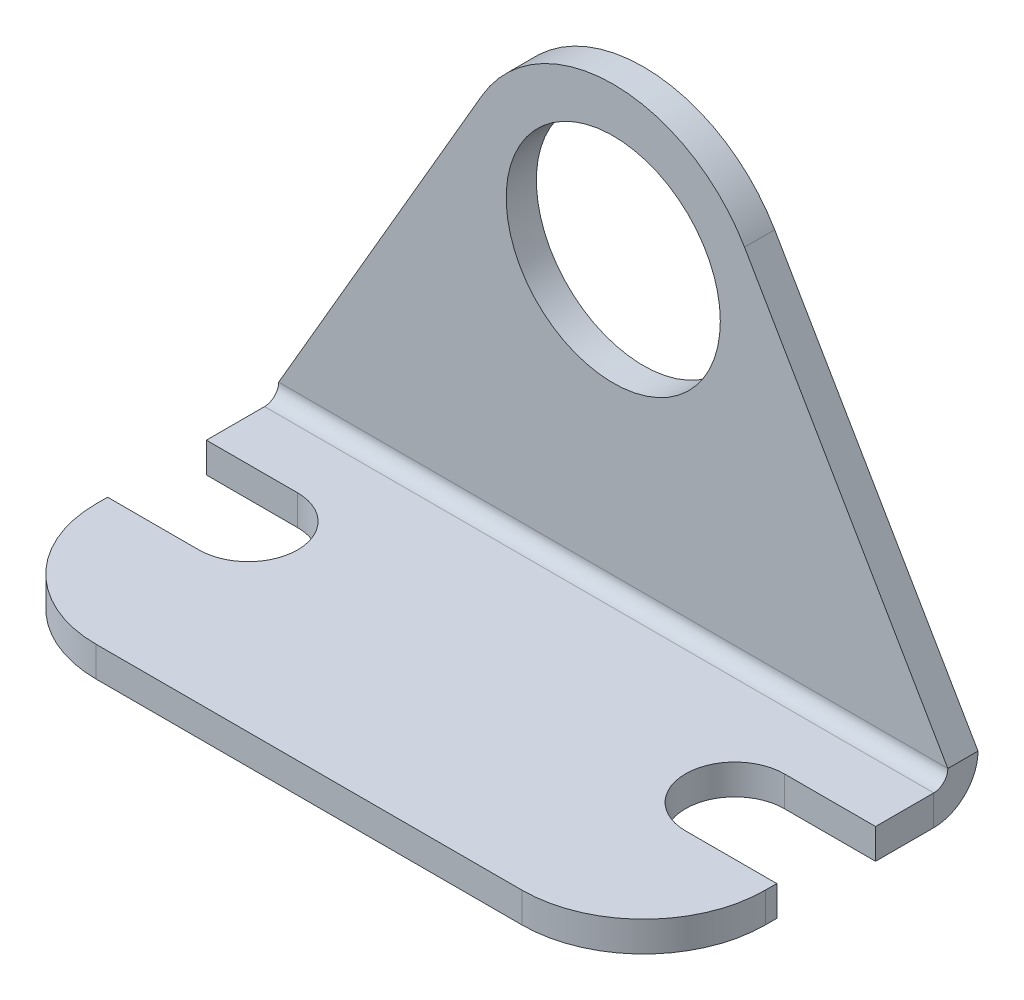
ISO-10303-21;
HEADER;
FILE_DESCRIPTION(('STEP AP214'),'2;1');
FILE_NAME('part.step','',(''),(''),'','','');
FILE_SCHEMA(('AUTOMOTIVE_DESIGN { 1 0 10303 214 1 1 1 1 }'));
ENDSEC;
DATA;
#1=APPLICATION_CONTEXT('core data for automotive mechanical design processes');
#2=APPLICATION_PROTOCOL_DEFINITION('international standard','automotive_design',2000,#1);
#3=PRODUCT_CONTEXT('',#1,'mechanical');
#4=PRODUCT('Part','Part','',(#3));
#5=PRODUCT_RELATED_PRODUCT_CATEGORY('part','',(#4));
#6=PRODUCT_DEFINITION_FORMATION('','',#4);
#7=PRODUCT_DEFINITION_CONTEXT('part definition',#1,'design');
#8=PRODUCT_DEFINITION('design','',#6,#7);
#9=PRODUCT_DEFINITION_SHAPE('','',#8);
#10=(LENGTH_UNIT() NAMED_UNIT(*) SI_UNIT(.MILLI.,.METRE.));
#11=(NAMED_UNIT(*) PLANE_ANGLE_UNIT() SI_UNIT($,.RADIAN.));
#12=(NAMED_UNIT(*) SI_UNIT($,.STERADIAN.) SOLID_ANGLE_UNIT());
#13=UNCERTAINTY_MEASURE_WITH_UNIT(LENGTH_MEASURE(1.E-05),#10,'distance_accuracy_value','');
#14=(GEOMETRIC_REPRESENTATION_CONTEXT(3) GLOBAL_UNCERTAINTY_ASSIGNED_CONTEXT((#13)) GLOBAL_UNIT_ASSIGNED_CONTEXT((#10,
#11,#12)) REPRESENTATION_CONTEXT('',''));
#15=CARTESIAN_POINT('',(0.,0.,0.));
#16=DIRECTION('',(0.,0.,1.));
#17=DIRECTION('',(1.,0.,0.));
#18=AXIS2_PLACEMENT_3D('',#15,#16,#17);
#19=CARTESIAN_POINT('',(17.4625,-16.5862000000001,17.4498));
#20=DIRECTION('',(-1.,0.,0.));
#21=DIRECTION('',(0.,-1.,0.));
#22=AXIS2_PLACEMENT_3D('',#19,#20,#21);
#23=PLANE('',#22);
#24=DIRECTION('',(0.,0.,1.));
#25=VECTOR('',#24,1.);
#26=CARTESIAN_POINT('',(17.4625,-16.5862000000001,17.4498));
#27=LINE('',#26,#25);
#28=CARTESIAN_POINT('',(17.4625,-16.5862000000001,10.5028999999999));
#29=VERTEX_POINT('',#28);
#30=CARTESIAN_POINT('',(17.4625,-16.5862,11.0998));
#31=VERTEX_POINT('',#30);
#32=EDGE_CURVE('E211',#29,#31,#27,.T.);
#33=ORIENTED_EDGE('',*,*,#32,.F.);
#34=DIRECTION('',(0.,1.,0.));
#35=VECTOR('',#34,1.);
#36=CARTESIAN_POINT('',(17.4625,-16.5862000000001,10.5028999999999));
#37=LINE('',#36,#35);
#38=CARTESIAN_POINT('',(17.4625,-15.0114,10.5028999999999));
#39=VERTEX_POINT('',#38);
#40=EDGE_CURVE('E343',#29,#39,#37,.T.);
#41=ORIENTED_EDGE('',*,*,#40,.T.);
#42=DIRECTION('',(0.,0.,-1.));
#43=VECTOR('',#42,1.);
#44=CARTESIAN_POINT('',(17.4625,-15.0114000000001,17.4498));
#45=LINE('',#44,#43);
#46=CARTESIAN_POINT('',(17.4625,-15.0114,11.0998));
#47=VERTEX_POINT('',#46);
#48=EDGE_CURVE('E226',#39,#47,#45,.F.);
#49=ORIENTED_EDGE('',*,*,#48,.T.);
#50=DIRECTION('',(0.,1.,0.));
#51=VECTOR('',#50,1.);
#52=CARTESIAN_POINT('',(17.4625,-16.5862,11.0998));
#53=LINE('',#52,#51);
#54=EDGE_CURVE('E297',#47,#31,#53,.F.);
#55=ORIENTED_EDGE('',*,*,#54,.T.);
#56=EDGE_LOOP('',(#33,#41,#49,#55));
#57=FACE_BOUND('',#56,.T.);
#58=ADVANCED_FACE('F61',(#57),#23,.F.);
#59=CARTESIAN_POINT('',(-17.4625,-16.5862,1.57479999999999));
#60=DIRECTION('',(1.,0.,0.));
#61=DIRECTION('',(0.,0.,-1.));
#62=AXIS2_PLACEMENT_3D('',#59,#60,#61);
#63=PLANE('',#62);
#64=DIRECTION('',(0.,0.,-1.));
#65=VECTOR('',#64,1.);
#66=CARTESIAN_POINT('',(-17.4625,-16.5862000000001,17.4498));
#67=LINE('',#66,#65);
#68=CARTESIAN_POINT('',(-17.4625,-16.5862000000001,5.34669999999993));
#69=VERTEX_POINT('',#68);
#70=CARTESIAN_POINT('',(-17.4625,-16.5862,2.31139999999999));
#71=VERTEX_POINT('',#70);
#72=EDGE_CURVE('E221',#69,#71,#67,.T.);
#73=ORIENTED_EDGE('',*,*,#72,.F.);
#74=DIRECTION('',(0.,1.,0.));
#75=VECTOR('',#74,1.);
#76=CARTESIAN_POINT('',(-17.4625,-16.5862000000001,5.34669999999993));
#77=LINE('',#76,#75);
#78=CARTESIAN_POINT('',(-17.4625,-15.0114,5.34669999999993));
#79=VERTEX_POINT('',#78);
#80=EDGE_CURVE('E240',#69,#79,#77,.T.);
#81=ORIENTED_EDGE('',*,*,#80,.T.);
#82=DIRECTION('',(0.,0.,1.));
#83=VECTOR('',#82,1.);
#84=CARTESIAN_POINT('',(-17.4625,-15.0114,1.5748));
#85=LINE('',#84,#83);
#86=CARTESIAN_POINT('',(-17.4625,-15.0114,2.3114));
#87=VERTEX_POINT('',#86);
#88=EDGE_CURVE('E230',#79,#87,#85,.F.);
#89=ORIENTED_EDGE('',*,*,#88,.T.);
#90=DIRECTION('',(0.,1.,0.));
#91=VECTOR('',#90,1.);
#92=CARTESIAN_POINT('',(-17.4625,-16.5862,2.31139999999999));
#93=LINE('',#92,#91);
#94=EDGE_CURVE('E237',#87,#71,#93,.F.);
#95=ORIENTED_EDGE('',*,*,#94,.T.);
#96=EDGE_LOOP('',(#73,#81,#89,#95));
#97=FACE_BOUND('',#96,.T.);
#98=ADVANCED_FACE('F368',(#97),#63,.F.);
#99=CARTESIAN_POINT('',(6.85164059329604,3.98214467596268,1.5748));
#100=DIRECTION('',(-0.864582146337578,-0.502491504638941,0.));
#101=DIRECTION('',(0.502491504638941,-0.864582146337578,0.));
#102=AXIS2_PLACEMENT_3D('',#99,#100,#101);
#103=PLANE('',#102);
#104=DIRECTION('',(-0.502491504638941,0.864582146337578,0.));
#105=VECTOR('',#104,1.);
#106=CARTESIAN_POINT('',(6.85164059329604,3.98214467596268,0.));
#107=LINE('',#106,#105);
#108=CARTESIAN_POINT('',(17.4625,-14.2748,0.));
#109=VERTEX_POINT('',#108);
#110=CARTESIAN_POINT('',(6.85164059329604,3.98214467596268,0.));
#111=VERTEX_POINT('',#110);
#112=EDGE_CURVE('E269',#109,#111,#107,.T.);
#113=ORIENTED_EDGE('',*,*,#112,.T.);
#114=DIRECTION('',(0.,0.,-1.));
#115=VECTOR('',#114,1.);
#116=CARTESIAN_POINT('',(6.85164059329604,3.98214467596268,1.5748));
#117=LINE('',#116,#115);
#118=CARTESIAN_POINT('',(6.85164059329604,3.98214467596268,1.5748));
#119=VERTEX_POINT('',#118);
#120=EDGE_CURVE('E282',#119,#111,#117,.T.);
#121=ORIENTED_EDGE('',*,*,#120,.F.);
#122=DIRECTION('',(-0.502491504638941,0.864582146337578,0.));
#123=VECTOR('',#122,1.);
#124=CARTESIAN_POINT('',(6.85164059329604,3.98214467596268,1.5748));
#125=LINE('',#124,#123);
#126=CARTESIAN_POINT('',(17.4625,-14.2748,1.5748));
#127=VERTEX_POINT('',#126);
#128=EDGE_CURVE('E256',#127,#119,#125,.T.);
#129=ORIENTED_EDGE('',*,*,#128,.F.);
#130=DIRECTION('',(0.,0.,-1.));
#131=VECTOR('',#130,1.);
#132=CARTESIAN_POINT('',(17.4625,-14.2748,1.5748));
#133=LINE('',#132,#131);
#134=EDGE_CURVE('E285',#127,#109,#133,.T.);
#135=ORIENTED_EDGE('',*,*,#134,.T.);
#136=EDGE_LOOP('',(#113,#121,#129,#135));
#137=FACE_BOUND('',#136,.T.);
#138=ADVANCED_FACE('F373',(#137),#103,.F.);
#139=CARTESIAN_POINT('',(0.,0.,1.5748));
#140=DIRECTION('',(0.,0.,-1.));
#141=DIRECTION('',(-1.,0.,0.));
#142=AXIS2_PLACEMENT_3D('',#139,#140,#141);
#143=CYLINDRICAL_SURFACE('',#142,7.9248);
#144=CARTESIAN_POINT('',(0.,0.,0.));
#145=DIRECTION('',(0.,0.,1.));
#146=DIRECTION('',(1.,0.,0.));
#147=AXIS2_PLACEMENT_3D('',#144,#145,#146);
#148=CIRCLE('',#147,7.9248);
#149=CARTESIAN_POINT('',(-6.85164059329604,3.98214467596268,0.));
#150=VERTEX_POINT('',#149);
#151=EDGE_CURVE('E271',#111,#150,#148,.T.);
#152=ORIENTED_EDGE('',*,*,#151,.T.);
#153=DIRECTION('',(0.,0.,-1.));
#154=VECTOR('',#153,1.);
#155=CARTESIAN_POINT('',(-6.85164059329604,3.98214467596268,1.5748));
#156=LINE('',#155,#154);
#157=CARTESIAN_POINT('',(-6.85164059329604,3.98214467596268,1.5748));
#158=VERTEX_POINT('',#157);
#159=EDGE_CURVE('E279',#158,#150,#156,.T.);
#160=ORIENTED_EDGE('',*,*,#159,.F.);
#161=CARTESIAN_POINT('',(0.,0.,1.5748));
#162=DIRECTION('',(0.,0.,1.));
#163=DIRECTION('',(1.,0.,0.));
#164=AXIS2_PLACEMENT_3D('',#161,#162,#163);
#165=CIRCLE('',#164,7.9248);
#166=EDGE_CURVE('E259',#119,#158,#165,.T.);
#167=ORIENTED_EDGE('',*,*,#166,.F.);
#168=ORIENTED_EDGE('',*,*,#120,.T.);
#169=EDGE_LOOP('',(#152,#160,#167,#168));
#170=FACE_BOUND('',#169,.T.);
#171=ADVANCED_FACE('F417',(#170),#143,.T.);
#172=CARTESIAN_POINT('',(-6.85164059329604,3.98214467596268,1.5748));
#173=DIRECTION('',(0.864582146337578,-0.502491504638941,0.));
#174=DIRECTION('',(0.502491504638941,0.864582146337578,0.));
#175=AXIS2_PLACEMENT_3D('',#172,#173,#174);
#176=PLANE('',#175);
#177=DIRECTION('',(-0.502491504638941,-0.864582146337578,0.));
#178=VECTOR('',#177,1.);
#179=CARTESIAN_POINT('',(-6.85164059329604,3.98214467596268,0.));
#180=LINE('',#179,#178);
#181=CARTESIAN_POINT('',(-17.4625,-14.2748,0.));
#182=VERTEX_POINT('',#181);
#183=EDGE_CURVE('E273',#150,#182,#180,.T.);
#184=ORIENTED_EDGE('',*,*,#183,.T.);
#185=DIRECTION('',(0.,0.,-1.));
#186=VECTOR('',#185,1.);
#187=CARTESIAN_POINT('',(-17.4625,-14.2748,1.5748));
#188=LINE('',#187,#186);
#189=CARTESIAN_POINT('',(-17.4625,-14.2748,1.5748));
#190=VERTEX_POINT('',#189);
#191=EDGE_CURVE('E266',#190,#182,#188,.T.);
#192=ORIENTED_EDGE('',*,*,#191,.F.);
#193=DIRECTION('',(-0.502491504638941,-0.864582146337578,0.));
#194=VECTOR('',#193,1.);
#195=CARTESIAN_POINT('',(-6.85164059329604,3.98214467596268,1.5748));
#196=LINE('',#195,#194);
#197=EDGE_CURVE('E261',#158,#190,#196,.T.);
#198=ORIENTED_EDGE('',*,*,#197,.F.);
#199=ORIENTED_EDGE('',*,*,#159,.T.);
#200=EDGE_LOOP('',(#184,#192,#198,#199));
#201=FACE_BOUND('',#200,.T.);
#202=ADVANCED_FACE('F413',(#201),#176,.F.);
#203=CARTESIAN_POINT('',(0.,0.,1.5748));
#204=DIRECTION('',(0.,0.,-1.));
#205=DIRECTION('',(-1.,0.,0.));
#206=AXIS2_PLACEMENT_3D('',#203,#204,#205);
#207=CYLINDRICAL_SURFACE('',#206,5.588);
#208=CARTESIAN_POINT('',(0.,0.,1.5748));
#209=DIRECTION('',(0.,0.,1.));
#210=DIRECTION('',(1.,0.,0.));
#211=AXIS2_PLACEMENT_3D('',#208,#209,#210);
#212=CIRCLE('',#211,5.588);
#213=CARTESIAN_POINT('',(5.588,0.,1.5748));
#214=VERTEX_POINT('',#213);
#215=EDGE_CURVE('E263',#214,#214,#212,.T.);
#216=ORIENTED_EDGE('',*,*,#215,.T.);
#217=EDGE_LOOP('',(#216));
#218=FACE_BOUND('',#217,.T.);
#219=CARTESIAN_POINT('',(0.,0.,0.));
#220=DIRECTION('',(0.,0.,1.));
#221=DIRECTION('',(1.,0.,0.));
#222=AXIS2_PLACEMENT_3D('',#219,#220,#221);
#223=CIRCLE('',#222,5.588);
#224=CARTESIAN_POINT('',(5.588,0.,0.));
#225=VERTEX_POINT('',#224);
#226=EDGE_CURVE('E257',#225,#225,#223,.T.);
#227=ORIENTED_EDGE('',*,*,#226,.F.);
#228=EDGE_LOOP('',(#227));
#229=FACE_BOUND('',#228,.T.);
#230=ADVANCED_FACE('F406',(#218,#229),#207,.F.);
#231=CARTESIAN_POINT('',(0.,0.,1.5748));
#232=DIRECTION('',(0.,0.,1.));
#233=DIRECTION('',(1.,0.,0.));
#234=AXIS2_PLACEMENT_3D('',#231,#232,#233);
#235=PLANE('',#234);
#236=DIRECTION('',(1.,0.,0.));
#237=VECTOR('',#236,1.);
#238=CARTESIAN_POINT('',(0.,-14.2748,1.5748));
#239=LINE('',#238,#237);
#240=EDGE_CURVE('E253',#190,#127,#239,.T.);
#241=ORIENTED_EDGE('',*,*,#240,.T.);
#242=ORIENTED_EDGE('',*,*,#128,.T.);
#243=ORIENTED_EDGE('',*,*,#166,.T.);
#244=ORIENTED_EDGE('',*,*,#197,.T.);
#245=EDGE_LOOP('',(#241,#242,#243,#244));
#246=FACE_BOUND('',#245,.T.);
#247=ORIENTED_EDGE('',*,*,#215,.F.);
#248=EDGE_LOOP('',(#247));
#249=FACE_BOUND('',#248,.T.);
#250=ADVANCED_FACE('F403',(#246,#249),#235,.T.);
#251=CARTESIAN_POINT('',(0.,0.,0.));
#252=DIRECTION('',(0.,0.,1.));
#253=DIRECTION('',(1.,0.,0.));
#254=AXIS2_PLACEMENT_3D('',#251,#252,#253);
#255=PLANE('',#254);
#256=DIRECTION('',(1.,0.,0.));
#257=VECTOR('',#256,1.);
#258=CARTESIAN_POINT('',(0.,-14.2748,0.));
#259=LINE('',#258,#257);
#260=EDGE_CURVE('E244',#182,#109,#259,.T.);
#261=ORIENTED_EDGE('',*,*,#260,.F.);
#262=ORIENTED_EDGE('',*,*,#183,.F.);
#263=ORIENTED_EDGE('',*,*,#151,.F.);
#264=ORIENTED_EDGE('',*,*,#112,.F.);
#265=EDGE_LOOP('',(#261,#262,#263,#264));
#266=FACE_BOUND('',#265,.T.);
#267=ORIENTED_EDGE('',*,*,#226,.T.);
#268=EDGE_LOOP('',(#267));
#269=FACE_BOUND('',#268,.T.);
#270=ADVANCED_FACE('F398',(#266,#269),#255,.F.);
#271=CARTESIAN_POINT('',(-17.4625,-14.2748,2.3114));
#272=DIRECTION('',(-1.,0.,0.));
#273=DIRECTION('',(0.,0.,1.));
#274=AXIS2_PLACEMENT_3D('',#271,#272,#273);
#275=PLANE('',#274);
#276=ORIENTED_EDGE('',*,*,#94,.F.);
#277=CARTESIAN_POINT('',(-17.4625,-14.2748,2.3114));
#278=DIRECTION('',(1.,0.,0.));
#279=DIRECTION('',(0.,0.,-1.));
#280=AXIS2_PLACEMENT_3D('',#277,#278,#279);
#281=CIRCLE('',#280,0.7366);
#282=EDGE_CURVE('E248',#190,#87,#281,.F.);
#283=ORIENTED_EDGE('',*,*,#282,.F.);
#284=ORIENTED_EDGE('',*,*,#191,.T.);
#285=CARTESIAN_POINT('',(-17.4625,-14.2748,2.3114));
#286=DIRECTION('',(1.,0.,0.));
#287=DIRECTION('',(0.,0.,-1.));
#288=AXIS2_PLACEMENT_3D('',#285,#286,#287);
#289=CIRCLE('',#288,2.3114);
#290=EDGE_CURVE('E241',#182,#71,#289,.F.);
#291=ORIENTED_EDGE('',*,*,#290,.T.);
#292=EDGE_LOOP('',(#276,#283,#284,#291));
#293=FACE_BOUND('',#292,.T.);
#294=ADVANCED_FACE('F395',(#293),#275,.T.);
#295=CARTESIAN_POINT('',(17.4625,-14.2748,2.3114));
#296=DIRECTION('',(-1.,0.,0.));
#297=DIRECTION('',(0.,0.,1.));
#298=AXIS2_PLACEMENT_3D('',#295,#296,#297);
#299=PLANE('',#298);
#300=CARTESIAN_POINT('',(17.4625,-14.2748,2.3114));
#301=DIRECTION('',(1.,0.,0.));
#302=DIRECTION('',(0.,0.,-1.));
#303=AXIS2_PLACEMENT_3D('',#300,#301,#302);
#304=CIRCLE('',#303,0.7366);
#305=CARTESIAN_POINT('',(17.4625,-15.0114,2.3114));
#306=VERTEX_POINT('',#305);
#307=EDGE_CURVE('E214',#306,#127,#304,.T.);
#308=ORIENTED_EDGE('',*,*,#307,.F.);
#309=DIRECTION('',(0.,1.,0.));
#310=VECTOR('',#309,1.);
#311=CARTESIAN_POINT('',(17.4625,-15.0114,2.31139999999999));
#312=LINE('',#311,#310);
#313=CARTESIAN_POINT('',(17.4625,-16.5862,2.31139999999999));
#314=VERTEX_POINT('',#313);
#315=EDGE_CURVE('E232',#306,#314,#312,.F.);
#316=ORIENTED_EDGE('',*,*,#315,.T.);
#317=CARTESIAN_POINT('',(17.4625,-14.2748,2.3114));
#318=DIRECTION('',(1.,0.,0.));
#319=DIRECTION('',(0.,0.,-1.));
#320=AXIS2_PLACEMENT_3D('',#317,#318,#319);
#321=CIRCLE('',#320,2.3114);
#322=EDGE_CURVE('E245',#314,#109,#321,.T.);
#323=ORIENTED_EDGE('',*,*,#322,.T.);
#324=ORIENTED_EDGE('',*,*,#134,.F.);
#325=EDGE_LOOP('',(#308,#316,#323,#324));
#326=FACE_BOUND('',#325,.T.);
#327=ADVANCED_FACE('F392',(#326),#299,.F.);
#328=CARTESIAN_POINT('',(17.4625,-14.2748,2.3114));
#329=DIRECTION('',(1.,0.,0.));
#330=DIRECTION('',(0.,-1.,0.));
#331=AXIS2_PLACEMENT_3D('',#328,#329,#330);
#332=CYLINDRICAL_SURFACE('',#331,2.3114);
#333=ORIENTED_EDGE('',*,*,#260,.T.);
#334=ORIENTED_EDGE('',*,*,#322,.F.);
#335=DIRECTION('',(1.,0.,0.));
#336=VECTOR('',#335,1.);
#337=CARTESIAN_POINT('',(-17.4625,-16.5862,2.31139999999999));
#338=LINE('',#337,#336);
#339=EDGE_CURVE('E209',#314,#71,#338,.F.);
#340=ORIENTED_EDGE('',*,*,#339,.T.);
#341=ORIENTED_EDGE('',*,*,#290,.F.);
#342=EDGE_LOOP('',(#333,#334,#340,#341));
#343=FACE_BOUND('',#342,.T.);
#344=ADVANCED_FACE('F387',(#343),#332,.T.);
#345=CARTESIAN_POINT('',(17.4625,-14.2748,2.3114));
#346=DIRECTION('',(1.,0.,0.));
#347=DIRECTION('',(0.,-1.,0.));
#348=AXIS2_PLACEMENT_3D('',#345,#346,#347);
#349=CYLINDRICAL_SURFACE('',#348,0.7366);
#350=ORIENTED_EDGE('',*,*,#240,.F.);
#351=ORIENTED_EDGE('',*,*,#282,.T.);
#352=DIRECTION('',(1.,0.,0.));
#353=VECTOR('',#352,1.);
#354=CARTESIAN_POINT('',(-17.4625,-15.0114,2.3114));
#355=LINE('',#354,#353);
#356=EDGE_CURVE('E235',#87,#306,#355,.T.);
#357=ORIENTED_EDGE('',*,*,#356,.T.);
#358=ORIENTED_EDGE('',*,*,#307,.T.);
#359=EDGE_LOOP('',(#350,#351,#357,#358));
#360=FACE_BOUND('',#359,.T.);
#361=ADVANCED_FACE('F383',(#360),#349,.F.);
#362=CARTESIAN_POINT('',(-17.4625,-15.0114,11.0998));
#363=VERTEX_POINT('',#362);
#364=CARTESIAN_POINT('',(-17.4625,-15.0114,10.5028999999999));
#365=VERTEX_POINT('',#364);
#366=EDGE_CURVE('E227',#363,#365,#85,.F.);
#367=ORIENTED_EDGE('',*,*,#366,.T.);
#368=DIRECTION('',(0.,1.,0.));
#369=VECTOR('',#368,1.);
#370=CARTESIAN_POINT('',(-17.4625,-16.5862000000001,10.5028999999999));
#371=LINE('',#370,#369);
#372=CARTESIAN_POINT('',(-17.4625,-16.5862000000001,10.5028999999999));
#373=VERTEX_POINT('',#372);
#374=EDGE_CURVE('E84',#373,#365,#371,.T.);
#375=ORIENTED_EDGE('',*,*,#374,.F.);
#376=CARTESIAN_POINT('',(-17.4625,-16.5862,11.0998));
#377=VERTEX_POINT('',#376);
#378=EDGE_CURVE('E216',#377,#373,#67,.T.);
#379=ORIENTED_EDGE('',*,*,#378,.F.);
#380=DIRECTION('',(0.,1.,0.));
#381=VECTOR('',#380,1.);
#382=CARTESIAN_POINT('',(-17.4625,-16.5862,11.0998));
#383=LINE('',#382,#381);
#384=EDGE_CURVE('E13',#377,#363,#383,.T.);
#385=ORIENTED_EDGE('',*,*,#384,.T.);
#386=EDGE_LOOP('',(#367,#375,#379,#385));
#387=FACE_BOUND('',#386,.T.);
#388=ADVANCED_FACE('F324',(#387),#63,.F.);
#389=CARTESIAN_POINT('',(17.4625,-15.0114,5.34669999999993));
#390=VERTEX_POINT('',#389);
#391=EDGE_CURVE('E203',#306,#390,#45,.F.);
#392=ORIENTED_EDGE('',*,*,#391,.T.);
#393=DIRECTION('',(0.,1.,0.));
#394=VECTOR('',#393,1.);
#395=CARTESIAN_POINT('',(17.4625,-16.5862000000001,5.34669999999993));
#396=LINE('',#395,#394);
#397=CARTESIAN_POINT('',(17.4625,-16.5862000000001,5.34669999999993));
#398=VERTEX_POINT('',#397);
#399=EDGE_CURVE('E76',#398,#390,#396,.T.);
#400=ORIENTED_EDGE('',*,*,#399,.F.);
#401=EDGE_CURVE('E201',#314,#398,#27,.T.);
#402=ORIENTED_EDGE('',*,*,#401,.F.);
#403=ORIENTED_EDGE('',*,*,#315,.F.);
#404=EDGE_LOOP('',(#392,#400,#402,#403));
#405=FACE_BOUND('',#404,.T.);
#406=ADVANCED_FACE('F199',(#405),#23,.F.);
#407=CARTESIAN_POINT('',(-17.4625,-16.5862000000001,17.4498));
#408=DIRECTION('',(0.,1.,0.));
#409=DIRECTION('',(0.,0.,1.));
#410=AXIS2_PLACEMENT_3D('',#407,#408,#409);
#411=PLANE('',#410);
#412=CARTESIAN_POINT('',(12.7,-16.5862000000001,7.92479999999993));
#413=DIRECTION('',(0.,1.,0.));
#414=DIRECTION('',(0.,0.,1.));
#415=AXIS2_PLACEMENT_3D('',#412,#413,#414);
#416=CIRCLE('',#415,2.5781);
#417=CARTESIAN_POINT('',(12.7,-16.5862000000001,5.34669999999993));
#418=VERTEX_POINT('',#417);
#419=CARTESIAN_POINT('',(12.7,-16.5862000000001,10.5028999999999));
#420=VERTEX_POINT('',#419);
#421=EDGE_CURVE('E193',#418,#420,#416,.T.);
#422=ORIENTED_EDGE('',*,*,#421,.T.);
#423=DIRECTION('',(1.,0.,0.));
#424=VECTOR('',#423,1.);
#425=CARTESIAN_POINT('',(17.4625,-16.5862000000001,10.5028999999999));
#426=LINE('',#425,#424);
#427=EDGE_CURVE('E204',#420,#29,#426,.T.);
#428=ORIENTED_EDGE('',*,*,#427,.T.);
#429=ORIENTED_EDGE('',*,*,#32,.T.);
#430=CARTESIAN_POINT('',(11.1125,-16.5862,11.0998));
#431=DIRECTION('',(0.,1.,0.));
#432=DIRECTION('',(0.,0.,1.));
#433=AXIS2_PLACEMENT_3D('',#430,#431,#432);
#434=CIRCLE('',#433,6.35);
#435=CARTESIAN_POINT('',(11.1125,-16.5862000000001,17.4498));
#436=VERTEX_POINT('',#435);
#437=EDGE_CURVE('E69',#31,#436,#434,.F.);
#438=ORIENTED_EDGE('',*,*,#437,.T.);
#439=DIRECTION('',(-1.,0.,0.));
#440=VECTOR('',#439,1.);
#441=CARTESIAN_POINT('',(-17.4625,-16.5862000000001,17.4498));
#442=LINE('',#441,#440);
#443=CARTESIAN_POINT('',(-11.1125,-16.5862000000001,17.4498));
#444=VERTEX_POINT('',#443);
#445=EDGE_CURVE('E210',#436,#444,#442,.T.);
#446=ORIENTED_EDGE('',*,*,#445,.T.);
#447=CARTESIAN_POINT('',(-11.1125,-16.5862,11.0998));
#448=DIRECTION('',(0.,1.,0.));
#449=DIRECTION('',(0.,0.,1.));
#450=AXIS2_PLACEMENT_3D('',#447,#448,#449);
#451=CIRCLE('',#450,6.35);
#452=EDGE_CURVE('E300',#444,#377,#451,.F.);
#453=ORIENTED_EDGE('',*,*,#452,.T.);
#454=ORIENTED_EDGE('',*,*,#378,.T.);
#455=DIRECTION('',(1.,0.,0.));
#456=VECTOR('',#455,1.);
#457=CARTESIAN_POINT('',(-17.4625,-16.5862000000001,10.5028999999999));
#458=LINE('',#457,#456);
#459=CARTESIAN_POINT('',(-12.7,-16.5862000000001,10.5028999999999));
#460=VERTEX_POINT('',#459);
#461=EDGE_CURVE('E338',#373,#460,#458,.T.);
#462=ORIENTED_EDGE('',*,*,#461,.T.);
#463=CARTESIAN_POINT('',(-12.7,-16.5862000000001,7.92479999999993));
#464=DIRECTION('',(0.,1.,0.));
#465=DIRECTION('',(0.,0.,1.));
#466=AXIS2_PLACEMENT_3D('',#463,#464,#465);
#467=CIRCLE('',#466,2.5781);
#468=CARTESIAN_POINT('',(-12.7,-16.5862000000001,5.34669999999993));
#469=VERTEX_POINT('',#468);
#470=EDGE_CURVE('E330',#460,#469,#467,.T.);
#471=ORIENTED_EDGE('',*,*,#470,.T.);
#472=DIRECTION('',(-1.,0.,0.));
#473=VECTOR('',#472,1.);
#474=CARTESIAN_POINT('',(-17.4625,-16.5862000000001,5.34669999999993));
#475=LINE('',#474,#473);
#476=EDGE_CURVE('E326',#469,#69,#475,.T.);
#477=ORIENTED_EDGE('',*,*,#476,.T.);
#478=ORIENTED_EDGE('',*,*,#72,.T.);
#479=ORIENTED_EDGE('',*,*,#339,.F.);
#480=ORIENTED_EDGE('',*,*,#401,.T.);
#481=DIRECTION('',(-1.,0.,0.));
#482=VECTOR('',#481,1.);
#483=CARTESIAN_POINT('',(17.4625,-16.5862000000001,5.34669999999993));
#484=LINE('',#483,#482);
#485=EDGE_CURVE('E186',#398,#418,#484,.T.);
#486=ORIENTED_EDGE('',*,*,#485,.T.);
#487=EDGE_LOOP('',(#422,#428,#429,#438,#446,#453,#454,#462,#471,#477,#478,#479,#480,#486));
#488=FACE_BOUND('',#487,.T.);
#489=ADVANCED_FACE('F207',(#488),#411,.F.);
#490=CARTESIAN_POINT('',(-17.4625,-15.0114000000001,17.4498));
#491=DIRECTION('',(0.,1.,0.));
#492=DIRECTION('',(0.,0.,1.));
#493=AXIS2_PLACEMENT_3D('',#490,#491,#492);
#494=PLANE('',#493);
#495=DIRECTION('',(1.,0.,0.));
#496=VECTOR('',#495,1.);
#497=CARTESIAN_POINT('',(17.4625,-15.0114,10.5028999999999));
#498=LINE('',#497,#496);
#499=CARTESIAN_POINT('',(12.7,-15.0114,10.5028999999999));
#500=VERTEX_POINT('',#499);
#501=EDGE_CURVE('E194',#500,#39,#498,.T.);
#502=ORIENTED_EDGE('',*,*,#501,.F.);
#503=CARTESIAN_POINT('',(12.7,-15.0114,7.92479999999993));
#504=DIRECTION('',(0.,1.,0.));
#505=DIRECTION('',(0.,0.,1.));
#506=AXIS2_PLACEMENT_3D('',#503,#504,#505);
#507=CIRCLE('',#506,2.5781);
#508=CARTESIAN_POINT('',(12.7,-15.0114,5.34669999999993));
#509=VERTEX_POINT('',#508);
#510=EDGE_CURVE('E354',#509,#500,#507,.T.);
#511=ORIENTED_EDGE('',*,*,#510,.F.);
#512=DIRECTION('',(-1.,0.,0.));
#513=VECTOR('',#512,1.);
#514=CARTESIAN_POINT('',(17.4625,-15.0114,5.34669999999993));
#515=LINE('',#514,#513);
#516=EDGE_CURVE('E357',#390,#509,#515,.T.);
#517=ORIENTED_EDGE('',*,*,#516,.F.);
#518=ORIENTED_EDGE('',*,*,#391,.F.);
#519=ORIENTED_EDGE('',*,*,#356,.F.);
#520=ORIENTED_EDGE('',*,*,#88,.F.);
#521=DIRECTION('',(-1.,0.,0.));
#522=VECTOR('',#521,1.);
#523=CARTESIAN_POINT('',(-17.4625,-15.0114,5.34669999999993));
#524=LINE('',#523,#522);
#525=CARTESIAN_POINT('',(-12.7,-15.0114,5.34669999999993));
#526=VERTEX_POINT('',#525);
#527=EDGE_CURVE('E336',#526,#79,#524,.T.);
#528=ORIENTED_EDGE('',*,*,#527,.F.);
#529=CARTESIAN_POINT('',(-12.7,-15.0114,7.92479999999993));
#530=DIRECTION('',(0.,1.,0.));
#531=DIRECTION('',(0.,0.,1.));
#532=AXIS2_PLACEMENT_3D('',#529,#530,#531);
#533=CIRCLE('',#532,2.5781);
#534=CARTESIAN_POINT('',(-12.7,-15.0114,10.5028999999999));
#535=VERTEX_POINT('',#534);
#536=EDGE_CURVE('E339',#535,#526,#533,.T.);
#537=ORIENTED_EDGE('',*,*,#536,.F.);
#538=DIRECTION('',(1.,0.,0.));
#539=VECTOR('',#538,1.);
#540=CARTESIAN_POINT('',(-17.4625,-15.0114,10.5028999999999));
#541=LINE('',#540,#539);
#542=EDGE_CURVE('E342',#365,#535,#541,.T.);
#543=ORIENTED_EDGE('',*,*,#542,.F.);
#544=ORIENTED_EDGE('',*,*,#366,.F.);
#545=CARTESIAN_POINT('',(-11.1125,-15.0114,11.0998));
#546=DIRECTION('',(0.,1.,0.));
#547=DIRECTION('',(0.,0.,1.));
#548=AXIS2_PLACEMENT_3D('',#545,#546,#547);
#549=CIRCLE('',#548,6.35);
#550=CARTESIAN_POINT('',(-11.1125,-15.0114000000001,17.4498));
#551=VERTEX_POINT('',#550);
#552=EDGE_CURVE('E292',#363,#551,#549,.T.);
#553=ORIENTED_EDGE('',*,*,#552,.T.);
#554=DIRECTION('',(1.,0.,0.));
#555=VECTOR('',#554,1.);
#556=CARTESIAN_POINT('',(-17.4625,-15.0114000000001,17.4498));
#557=LINE('',#556,#555);
#558=CARTESIAN_POINT('',(11.1125,-15.0114000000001,17.4498));
#559=VERTEX_POINT('',#558);
#560=EDGE_CURVE('E222',#559,#551,#557,.F.);
#561=ORIENTED_EDGE('',*,*,#560,.F.);
#562=CARTESIAN_POINT('',(11.1125,-15.0114,11.0998));
#563=DIRECTION('',(0.,1.,0.));
#564=DIRECTION('',(0.,0.,1.));
#565=AXIS2_PLACEMENT_3D('',#562,#563,#564);
#566=CIRCLE('',#565,6.35);
#567=EDGE_CURVE('E294',#559,#47,#566,.T.);
#568=ORIENTED_EDGE('',*,*,#567,.T.);
#569=ORIENTED_EDGE('',*,*,#48,.F.);
#570=EDGE_LOOP('',(#502,#511,#517,#518,#519,#520,#528,#537,#543,#544,#553,#561,#568,#569));
#571=FACE_BOUND('',#570,.T.);
#572=ADVANCED_FACE('F317',(#571),#494,.T.);
#573=CARTESIAN_POINT('',(-17.4625,-16.5862000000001,17.4498));
#574=DIRECTION('',(0.,0.,-1.));
#575=DIRECTION('',(0.,1.,0.));
#576=AXIS2_PLACEMENT_3D('',#573,#574,#575);
#577=PLANE('',#576);
#578=ORIENTED_EDGE('',*,*,#445,.F.);
#579=DIRECTION('',(0.,1.,0.));
#580=VECTOR('',#579,1.);
#581=CARTESIAN_POINT('',(11.1125,-16.5862000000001,17.4498));
#582=LINE('',#581,#580);
#583=EDGE_CURVE('E289',#436,#559,#582,.T.);
#584=ORIENTED_EDGE('',*,*,#583,.T.);
#585=ORIENTED_EDGE('',*,*,#560,.T.);
#586=DIRECTION('',(0.,1.,0.));
#587=VECTOR('',#586,1.);
#588=CARTESIAN_POINT('',(-11.1125,-16.5862000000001,17.4498));
#589=LINE('',#588,#587);
#590=EDGE_CURVE('E287',#551,#444,#589,.F.);
#591=ORIENTED_EDGE('',*,*,#590,.T.);
#592=EDGE_LOOP('',(#578,#584,#585,#591));
#593=FACE_BOUND('',#592,.T.);
#594=ADVANCED_FACE('F310',(#593),#577,.F.);
#595=CARTESIAN_POINT('',(11.1125,-16.5862,11.0998));
#596=DIRECTION('',(0.,1.,0.));
#597=DIRECTION('',(0.,0.,1.));
#598=AXIS2_PLACEMENT_3D('',#595,#596,#597);
#599=CYLINDRICAL_SURFACE('',#598,6.35);
#600=ORIENTED_EDGE('',*,*,#437,.F.);
#601=ORIENTED_EDGE('',*,*,#54,.F.);
#602=ORIENTED_EDGE('',*,*,#567,.F.);
#603=ORIENTED_EDGE('',*,*,#583,.F.);
#604=EDGE_LOOP('',(#600,#601,#602,#603));
#605=FACE_BOUND('',#604,.T.);
#606=ADVANCED_FACE('F313',(#605),#599,.T.);
#607=CARTESIAN_POINT('',(-11.1125,-16.5862,11.0998));
#608=DIRECTION('',(0.,1.,0.));
#609=DIRECTION('',(0.,0.,1.));
#610=AXIS2_PLACEMENT_3D('',#607,#608,#609);
#611=CYLINDRICAL_SURFACE('',#610,6.35);
#612=ORIENTED_EDGE('',*,*,#452,.F.);
#613=ORIENTED_EDGE('',*,*,#590,.F.);
#614=ORIENTED_EDGE('',*,*,#552,.F.);
#615=ORIENTED_EDGE('',*,*,#384,.F.);
#616=EDGE_LOOP('',(#612,#613,#614,#615));
#617=FACE_BOUND('',#616,.T.);
#618=ADVANCED_FACE('F63',(#617),#611,.T.);
#619=CARTESIAN_POINT('',(-17.4625,-16.5862000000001,5.34669999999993));
#620=DIRECTION('',(0.,0.,-1.));
#621=DIRECTION('',(0.,1.,0.));
#622=AXIS2_PLACEMENT_3D('',#619,#620,#621);
#623=PLANE('',#622);
#624=ORIENTED_EDGE('',*,*,#527,.T.);
#625=ORIENTED_EDGE('',*,*,#80,.F.);
#626=ORIENTED_EDGE('',*,*,#476,.F.);
#627=DIRECTION('',(0.,1.,0.));
#628=VECTOR('',#627,1.);
#629=CARTESIAN_POINT('',(-12.7,-16.5862000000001,5.34669999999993));
#630=LINE('',#629,#628);
#631=EDGE_CURVE('E327',#469,#526,#630,.T.);
#632=ORIENTED_EDGE('',*,*,#631,.T.);
#633=EDGE_LOOP('',(#624,#625,#626,#632));
#634=FACE_BOUND('',#633,.T.);
#635=ADVANCED_FACE('F429',(#634),#623,.F.);
#636=CARTESIAN_POINT('',(-12.7,-16.5862000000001,7.92479999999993));
#637=DIRECTION('',(0.,1.,0.));
#638=DIRECTION('',(0.,0.,1.));
#639=AXIS2_PLACEMENT_3D('',#636,#637,#638);
#640=CYLINDRICAL_SURFACE('',#639,2.5781);
#641=ORIENTED_EDGE('',*,*,#536,.T.);
#642=ORIENTED_EDGE('',*,*,#631,.F.);
#643=ORIENTED_EDGE('',*,*,#470,.F.);
#644=DIRECTION('',(0.,1.,0.));
#645=VECTOR('',#644,1.);
#646=CARTESIAN_POINT('',(-12.7,-16.5862000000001,10.5028999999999));
#647=LINE('',#646,#645);
#648=EDGE_CURVE('E325',#460,#535,#647,.T.);
#649=ORIENTED_EDGE('',*,*,#648,.T.);
#650=EDGE_LOOP('',(#641,#642,#643,#649));
#651=FACE_BOUND('',#650,.T.);
#652=ADVANCED_FACE('F438',(#651),#640,.F.);
#653=CARTESIAN_POINT('',(-17.4625,-16.5862000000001,10.5028999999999));
#654=DIRECTION('',(0.,0.,1.));
#655=DIRECTION('',(0.,-1.,0.));
#656=AXIS2_PLACEMENT_3D('',#653,#654,#655);
#657=PLANE('',#656);
#658=ORIENTED_EDGE('',*,*,#542,.T.);
#659=ORIENTED_EDGE('',*,*,#648,.F.);
#660=ORIENTED_EDGE('',*,*,#461,.F.);
#661=ORIENTED_EDGE('',*,*,#374,.T.);
#662=EDGE_LOOP('',(#658,#659,#660,#661));
#663=FACE_BOUND('',#662,.T.);
#664=ADVANCED_FACE('F435',(#663),#657,.F.);
#665=CARTESIAN_POINT('',(17.4625,-16.5862000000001,10.5028999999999));
#666=DIRECTION('',(0.,0.,1.));
#667=DIRECTION('',(0.,-1.,0.));
#668=AXIS2_PLACEMENT_3D('',#665,#666,#667);
#669=PLANE('',#668);
#670=ORIENTED_EDGE('',*,*,#501,.T.);
#671=ORIENTED_EDGE('',*,*,#40,.F.);
#672=ORIENTED_EDGE('',*,*,#427,.F.);
#673=DIRECTION('',(0.,1.,0.));
#674=VECTOR('',#673,1.);
#675=CARTESIAN_POINT('',(12.7,-16.5862000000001,10.5028999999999));
#676=LINE('',#675,#674);
#677=EDGE_CURVE('E349',#420,#500,#676,.T.);
#678=ORIENTED_EDGE('',*,*,#677,.T.);
#679=EDGE_LOOP('',(#670,#671,#672,#678));
#680=FACE_BOUND('',#679,.T.);
#681=ADVANCED_FACE('F365',(#680),#669,.F.);
#682=CARTESIAN_POINT('',(12.7,-16.5862000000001,7.92479999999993));
#683=DIRECTION('',(0.,1.,0.));
#684=DIRECTION('',(0.,0.,1.));
#685=AXIS2_PLACEMENT_3D('',#682,#683,#684);
#686=CYLINDRICAL_SURFACE('',#685,2.5781);
#687=ORIENTED_EDGE('',*,*,#510,.T.);
#688=ORIENTED_EDGE('',*,*,#677,.F.);
#689=ORIENTED_EDGE('',*,*,#421,.F.);
#690=DIRECTION('',(0.,1.,0.));
#691=VECTOR('',#690,1.);
#692=CARTESIAN_POINT('',(12.7,-16.5862000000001,5.34669999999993));
#693=LINE('',#692,#691);
#694=EDGE_CURVE('E188',#418,#509,#693,.T.);
#695=ORIENTED_EDGE('',*,*,#694,.T.);
#696=EDGE_LOOP('',(#687,#688,#689,#695));
#697=FACE_BOUND('',#696,.T.);
#698=ADVANCED_FACE('F362',(#697),#686,.F.);
#699=CARTESIAN_POINT('',(17.4625,-16.5862000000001,5.34669999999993));
#700=DIRECTION('',(0.,0.,-1.));
#701=DIRECTION('',(0.,1.,0.));
#702=AXIS2_PLACEMENT_3D('',#699,#700,#701);
#703=PLANE('',#702);
#704=ORIENTED_EDGE('',*,*,#516,.T.);
#705=ORIENTED_EDGE('',*,*,#694,.F.);
#706=ORIENTED_EDGE('',*,*,#485,.F.);
#707=ORIENTED_EDGE('',*,*,#399,.T.);
#708=EDGE_LOOP('',(#704,#705,#706,#707));
#709=FACE_BOUND('',#708,.T.);
#710=ADVANCED_FACE('F187',(#709),#703,.F.);
#711=CLOSED_SHELL('',(#58,#98,#138,#171,#202,#230,#250,#270,#294,#327,#344,#361,#388,#406,#489,
#572,#594,#606,#618,#635,#652,#664,#681,#698,#710));
#712=MANIFOLD_SOLID_BREP('B2',#711);
#713=ADVANCED_BREP_SHAPE_REPRESENTATION('',(#18,#712),#14);
#714=SHAPE_DEFINITION_REPRESENTATION(#9,#713);
ENDSEC;
END-ISO-10303-21;
